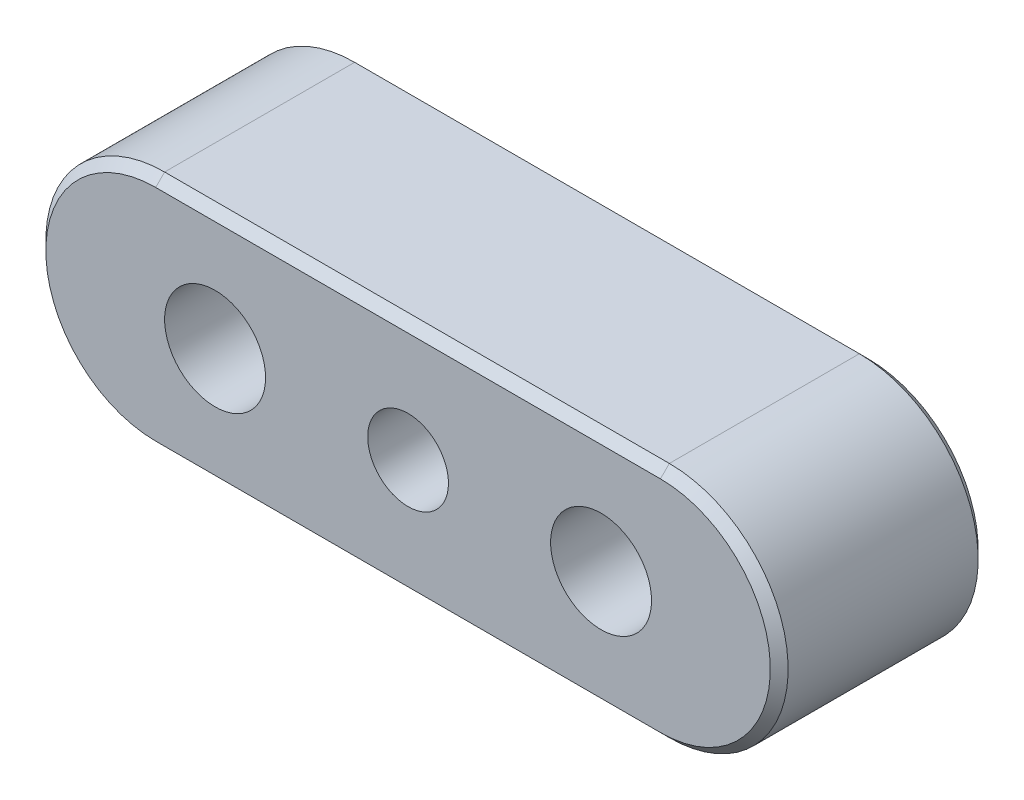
ISO-10303-21;
HEADER;
FILE_DESCRIPTION(('STEP AP214'),'2;1');
FILE_NAME('part.step','',(''),(''),'','','');
FILE_SCHEMA(('AUTOMOTIVE_DESIGN { 1 0 10303 214 1 1 1 1 }'));
ENDSEC;
DATA;
#1=APPLICATION_CONTEXT('core data for automotive mechanical design processes');
#2=APPLICATION_PROTOCOL_DEFINITION('international standard','automotive_design',2000,#1);
#3=PRODUCT_CONTEXT('',#1,'mechanical');
#4=PRODUCT('Part','Part','',(#3));
#5=PRODUCT_RELATED_PRODUCT_CATEGORY('part','',(#4));
#6=PRODUCT_DEFINITION_FORMATION('','',#4);
#7=PRODUCT_DEFINITION_CONTEXT('part definition',#1,'design');
#8=PRODUCT_DEFINITION('design','',#6,#7);
#9=PRODUCT_DEFINITION_SHAPE('','',#8);
#10=(LENGTH_UNIT() NAMED_UNIT(*) SI_UNIT(.MILLI.,.METRE.));
#11=(NAMED_UNIT(*) PLANE_ANGLE_UNIT() SI_UNIT($,.RADIAN.));
#12=(NAMED_UNIT(*) SI_UNIT($,.STERADIAN.) SOLID_ANGLE_UNIT());
#13=UNCERTAINTY_MEASURE_WITH_UNIT(LENGTH_MEASURE(1.E-05),#10,'distance_accuracy_value','');
#14=(GEOMETRIC_REPRESENTATION_CONTEXT(3) GLOBAL_UNCERTAINTY_ASSIGNED_CONTEXT((#13)) GLOBAL_UNIT_ASSIGNED_CONTEXT((#10,
#11,#12)) REPRESENTATION_CONTEXT('',''));
#15=CARTESIAN_POINT('',(0.,0.,0.));
#16=DIRECTION('',(0.,0.,1.));
#17=DIRECTION('',(1.,0.,0.));
#18=AXIS2_PLACEMENT_3D('',#15,#16,#17);
#19=CARTESIAN_POINT('',(-15.,0.,-3.5));
#20=DIRECTION('',(0.,0.,1.));
#21=DIRECTION('',(1.,0.,0.));
#22=AXIS2_PLACEMENT_3D('',#19,#20,#21);
#23=CYLINDRICAL_SURFACE('',#22,1.7);
#24=CARTESIAN_POINT('',(-15.,0.,3.5));
#25=DIRECTION('',(0.,0.,1.));
#26=DIRECTION('',(1.,0.,0.));
#27=AXIS2_PLACEMENT_3D('',#24,#25,#26);
#28=CIRCLE('',#27,1.7);
#29=CARTESIAN_POINT('',(-13.3,0.,3.5));
#30=VERTEX_POINT('',#29);
#31=EDGE_CURVE('E194',#30,#30,#28,.T.);
#32=ORIENTED_EDGE('',*,*,#31,.T.);
#33=EDGE_LOOP('',(#32));
#34=FACE_BOUND('',#33,.T.);
#35=CARTESIAN_POINT('',(-15.,0.,-1.09999999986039));
#36=DIRECTION('',(0.,0.,-1.));
#37=DIRECTION('',(-1.,0.,0.));
#38=AXIS2_PLACEMENT_3D('',#35,#36,#37);
#39=CIRCLE('',#38,1.7);
#40=CARTESIAN_POINT('',(-16.7,0.,-1.09999999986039));
#41=VERTEX_POINT('',#40);
#42=EDGE_CURVE('E187',#41,#41,#39,.F.);
#43=ORIENTED_EDGE('',*,*,#42,.F.);
#44=EDGE_LOOP('',(#43));
#45=FACE_BOUND('',#44,.T.);
#46=ADVANCED_FACE('F44',(#34,#45),#23,.F.);
#47=CARTESIAN_POINT('',(-2.00000000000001,0.,-3.5));
#48=DIRECTION('',(0.,0.,1.));
#49=DIRECTION('',(1.,0.,0.));
#50=AXIS2_PLACEMENT_3D('',#47,#48,#49);
#51=CYLINDRICAL_SURFACE('',#50,1.7);
#52=CARTESIAN_POINT('',(-2.00000000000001,0.,3.5));
#53=DIRECTION('',(0.,0.,1.));
#54=DIRECTION('',(1.,0.,0.));
#55=AXIS2_PLACEMENT_3D('',#52,#53,#54);
#56=CIRCLE('',#55,1.7);
#57=CARTESIAN_POINT('',(-0.300000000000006,0.,3.5));
#58=VERTEX_POINT('',#57);
#59=EDGE_CURVE('E206',#58,#58,#56,.T.);
#60=ORIENTED_EDGE('',*,*,#59,.T.);
#61=EDGE_LOOP('',(#60));
#62=FACE_BOUND('',#61,.T.);
#63=CARTESIAN_POINT('',(-2.00000000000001,0.,-1.09999999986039));
#64=DIRECTION('',(0.,0.,-1.));
#65=DIRECTION('',(-1.,0.,0.));
#66=AXIS2_PLACEMENT_3D('',#63,#64,#65);
#67=CIRCLE('',#66,1.7);
#68=CARTESIAN_POINT('',(-3.70000000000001,0.,-1.09999999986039));
#69=VERTEX_POINT('',#68);
#70=EDGE_CURVE('E193',#69,#69,#67,.F.);
#71=ORIENTED_EDGE('',*,*,#70,.F.);
#72=EDGE_LOOP('',(#71));
#73=FACE_BOUND('',#72,.T.);
#74=ADVANCED_FACE('F261',(#62,#73),#51,.F.);
#75=CARTESIAN_POINT('',(-17.,0.,3.5));
#76=DIRECTION('',(0.,0.,-1.));
#77=DIRECTION('',(-1.,0.,0.));
#78=AXIS2_PLACEMENT_3D('',#75,#76,#77);
#79=CYLINDRICAL_SURFACE('',#78,4.);
#80=DIRECTION('',(0.,0.,-1.));
#81=VECTOR('',#80,1.);
#82=CARTESIAN_POINT('',(-17.,4.,3.5));
#83=LINE('',#82,#81);
#84=CARTESIAN_POINT('',(-17.,4.,3.2));
#85=VERTEX_POINT('',#84);
#86=CARTESIAN_POINT('',(-17.,4.,-3.2));
#87=VERTEX_POINT('',#86);
#88=EDGE_CURVE('E114',#85,#87,#83,.T.);
#89=ORIENTED_EDGE('',*,*,#88,.T.);
#90=CARTESIAN_POINT('',(-17.,0.,-3.2));
#91=DIRECTION('',(0.,0.,-1.));
#92=DIRECTION('',(-1.,0.,0.));
#93=AXIS2_PLACEMENT_3D('',#90,#91,#92);
#94=CIRCLE('',#93,4.);
#95=CARTESIAN_POINT('',(-17.,-4.,-3.2));
#96=VERTEX_POINT('',#95);
#97=EDGE_CURVE('E65',#87,#96,#94,.F.);
#98=ORIENTED_EDGE('',*,*,#97,.T.);
#99=DIRECTION('',(0.,0.,-1.));
#100=VECTOR('',#99,1.);
#101=CARTESIAN_POINT('',(-17.,-4.,3.5));
#102=LINE('',#101,#100);
#103=CARTESIAN_POINT('',(-17.,-4.,3.2));
#104=VERTEX_POINT('',#103);
#105=EDGE_CURVE('E116',#104,#96,#102,.T.);
#106=ORIENTED_EDGE('',*,*,#105,.F.);
#107=CARTESIAN_POINT('',(-17.,0.,3.2));
#108=DIRECTION('',(0.,0.,-1.));
#109=DIRECTION('',(-1.,0.,0.));
#110=AXIS2_PLACEMENT_3D('',#107,#108,#109);
#111=CIRCLE('',#110,4.);
#112=EDGE_CURVE('E115',#104,#85,#111,.T.);
#113=ORIENTED_EDGE('',*,*,#112,.T.);
#114=EDGE_LOOP('',(#89,#98,#106,#113));
#115=FACE_BOUND('',#114,.T.);
#116=ADVANCED_FACE('F112',(#115),#79,.T.);
#117=CARTESIAN_POINT('',(0.,-4.,3.5));
#118=DIRECTION('',(0.,1.,0.));
#119=DIRECTION('',(-1.,0.,0.));
#120=AXIS2_PLACEMENT_3D('',#117,#118,#119);
#121=PLANE('',#120);
#122=DIRECTION('',(0.,0.,-1.));
#123=VECTOR('',#122,1.);
#124=CARTESIAN_POINT('',(0.,-4.,3.5));
#125=LINE('',#124,#123);
#126=CARTESIAN_POINT('',(0.,-4.,3.2));
#127=VERTEX_POINT('',#126);
#128=CARTESIAN_POINT('',(0.,-4.,-3.2));
#129=VERTEX_POINT('',#128);
#130=EDGE_CURVE('E205',#127,#129,#125,.T.);
#131=ORIENTED_EDGE('',*,*,#130,.F.);
#132=DIRECTION('',(-1.,0.,0.));
#133=VECTOR('',#132,1.);
#134=CARTESIAN_POINT('',(0.,-4.,3.2));
#135=LINE('',#134,#133);
#136=EDGE_CURVE('E119',#127,#104,#135,.T.);
#137=ORIENTED_EDGE('',*,*,#136,.T.);
#138=ORIENTED_EDGE('',*,*,#105,.T.);
#139=DIRECTION('',(1.,0.,0.));
#140=VECTOR('',#139,1.);
#141=CARTESIAN_POINT('',(0.,-4.,-3.2));
#142=LINE('',#141,#140);
#143=EDGE_CURVE('E168',#96,#129,#142,.T.);
#144=ORIENTED_EDGE('',*,*,#143,.T.);
#145=EDGE_LOOP('',(#131,#137,#138,#144));
#146=FACE_BOUND('',#145,.T.);
#147=ADVANCED_FACE('F284',(#146),#121,.F.);
#148=CARTESIAN_POINT('',(0.,0.,3.5));
#149=DIRECTION('',(0.,0.,-1.));
#150=DIRECTION('',(-1.,0.,0.));
#151=AXIS2_PLACEMENT_3D('',#148,#149,#150);
#152=CYLINDRICAL_SURFACE('',#151,4.);
#153=ORIENTED_EDGE('',*,*,#130,.T.);
#154=CARTESIAN_POINT('',(0.,0.,-3.2));
#155=DIRECTION('',(0.,0.,-1.));
#156=DIRECTION('',(-1.,0.,0.));
#157=AXIS2_PLACEMENT_3D('',#154,#155,#156);
#158=CIRCLE('',#157,4.);
#159=CARTESIAN_POINT('',(0.,4.,-3.2));
#160=VERTEX_POINT('',#159);
#161=EDGE_CURVE('E11',#129,#160,#158,.F.);
#162=ORIENTED_EDGE('',*,*,#161,.T.);
#163=DIRECTION('',(0.,0.,-1.));
#164=VECTOR('',#163,1.);
#165=CARTESIAN_POINT('',(0.,4.,3.5));
#166=LINE('',#165,#164);
#167=CARTESIAN_POINT('',(0.,4.,3.2));
#168=VERTEX_POINT('',#167);
#169=EDGE_CURVE('E134',#168,#160,#166,.T.);
#170=ORIENTED_EDGE('',*,*,#169,.F.);
#171=CARTESIAN_POINT('',(0.,0.,3.2));
#172=DIRECTION('',(0.,0.,-1.));
#173=DIRECTION('',(-1.,0.,0.));
#174=AXIS2_PLACEMENT_3D('',#171,#172,#173);
#175=CIRCLE('',#174,4.);
#176=EDGE_CURVE('E53',#168,#127,#175,.T.);
#177=ORIENTED_EDGE('',*,*,#176,.T.);
#178=EDGE_LOOP('',(#153,#162,#170,#177));
#179=FACE_BOUND('',#178,.T.);
#180=ADVANCED_FACE('F276',(#179),#152,.T.);
#181=CARTESIAN_POINT('',(-17.,4.,3.5));
#182=DIRECTION('',(0.,-1.,0.));
#183=DIRECTION('',(0.,0.,-1.));
#184=AXIS2_PLACEMENT_3D('',#181,#182,#183);
#185=PLANE('',#184);
#186=ORIENTED_EDGE('',*,*,#169,.T.);
#187=DIRECTION('',(-1.,0.,0.));
#188=VECTOR('',#187,1.);
#189=CARTESIAN_POINT('',(-17.,4.,-3.2));
#190=LINE('',#189,#188);
#191=EDGE_CURVE('E127',#160,#87,#190,.T.);
#192=ORIENTED_EDGE('',*,*,#191,.T.);
#193=ORIENTED_EDGE('',*,*,#88,.F.);
#194=DIRECTION('',(1.,0.,0.));
#195=VECTOR('',#194,1.);
#196=CARTESIAN_POINT('',(-17.,4.,3.2));
#197=LINE('',#196,#195);
#198=EDGE_CURVE('E130',#85,#168,#197,.T.);
#199=ORIENTED_EDGE('',*,*,#198,.T.);
#200=EDGE_LOOP('',(#186,#192,#193,#199));
#201=FACE_BOUND('',#200,.T.);
#202=ADVANCED_FACE('F128',(#201),#185,.F.);
#203=CARTESIAN_POINT('',(-17.,0.,3.5));
#204=DIRECTION('',(0.,0.,-1.));
#205=DIRECTION('',(-1.,0.,0.));
#206=AXIS2_PLACEMENT_3D('',#203,#204,#205);
#207=PLANE('',#206);
#208=CARTESIAN_POINT('',(-17.,0.,3.5));
#209=DIRECTION('',(0.,0.,-1.));
#210=DIRECTION('',(-1.,0.,0.));
#211=AXIS2_PLACEMENT_3D('',#208,#209,#210);
#212=CIRCLE('',#211,3.7);
#213=CARTESIAN_POINT('',(-17.,3.7,3.5));
#214=VERTEX_POINT('',#213);
#215=CARTESIAN_POINT('',(-17.,-3.7,3.5));
#216=VERTEX_POINT('',#215);
#217=EDGE_CURVE('E143',#214,#216,#212,.F.);
#218=ORIENTED_EDGE('',*,*,#217,.T.);
#219=DIRECTION('',(1.,0.,0.));
#220=VECTOR('',#219,1.);
#221=CARTESIAN_POINT('',(-17.,-3.7,3.5));
#222=LINE('',#221,#220);
#223=CARTESIAN_POINT('',(0.,-3.7,3.5));
#224=VERTEX_POINT('',#223);
#225=EDGE_CURVE('E166',#216,#224,#222,.T.);
#226=ORIENTED_EDGE('',*,*,#225,.T.);
#227=CARTESIAN_POINT('',(0.,0.,3.5));
#228=DIRECTION('',(0.,0.,-1.));
#229=DIRECTION('',(-1.,0.,0.));
#230=AXIS2_PLACEMENT_3D('',#227,#228,#229);
#231=CIRCLE('',#230,3.7);
#232=CARTESIAN_POINT('',(0.,3.7,3.5));
#233=VERTEX_POINT('',#232);
#234=EDGE_CURVE('E171',#224,#233,#231,.F.);
#235=ORIENTED_EDGE('',*,*,#234,.T.);
#236=DIRECTION('',(-1.,0.,0.));
#237=VECTOR('',#236,1.);
#238=CARTESIAN_POINT('',(-17.,3.7,3.5));
#239=LINE('',#238,#237);
#240=EDGE_CURVE('E172',#233,#214,#239,.T.);
#241=ORIENTED_EDGE('',*,*,#240,.T.);
#242=EDGE_LOOP('',(#218,#226,#235,#241));
#243=FACE_BOUND('',#242,.T.);
#244=ORIENTED_EDGE('',*,*,#31,.F.);
#245=EDGE_LOOP('',(#244));
#246=FACE_BOUND('',#245,.T.);
#247=ORIENTED_EDGE('',*,*,#59,.F.);
#248=EDGE_LOOP('',(#247));
#249=FACE_BOUND('',#248,.T.);
#250=CARTESIAN_POINT('',(-8.5,0.,3.5));
#251=DIRECTION('',(0.,0.,1.));
#252=DIRECTION('',(1.,0.,0.));
#253=AXIS2_PLACEMENT_3D('',#250,#251,#252);
#254=CIRCLE('',#253,1.36);
#255=CARTESIAN_POINT('',(-7.14,0.,3.5));
#256=VERTEX_POINT('',#255);
#257=EDGE_CURVE('E131',#256,#256,#254,.T.);
#258=ORIENTED_EDGE('',*,*,#257,.F.);
#259=EDGE_LOOP('',(#258));
#260=FACE_BOUND('',#259,.T.);
#261=ADVANCED_FACE('F236',(#243,#246,#249,#260),#207,.F.);
#262=CARTESIAN_POINT('',(-17.,0.,-3.5));
#263=DIRECTION('',(0.,0.,-1.));
#264=DIRECTION('',(-1.,0.,0.));
#265=AXIS2_PLACEMENT_3D('',#262,#263,#264);
#266=PLANE('',#265);
#267=CARTESIAN_POINT('',(-17.,0.,-3.5));
#268=DIRECTION('',(0.,0.,-1.));
#269=DIRECTION('',(-1.,0.,0.));
#270=AXIS2_PLACEMENT_3D('',#267,#268,#269);
#271=CIRCLE('',#270,3.7);
#272=CARTESIAN_POINT('',(-17.,-3.7,-3.5));
#273=VERTEX_POINT('',#272);
#274=CARTESIAN_POINT('',(-17.,3.7,-3.5));
#275=VERTEX_POINT('',#274);
#276=EDGE_CURVE('E177',#273,#275,#271,.T.);
#277=ORIENTED_EDGE('',*,*,#276,.T.);
#278=DIRECTION('',(1.,0.,0.));
#279=VECTOR('',#278,1.);
#280=CARTESIAN_POINT('',(0.,3.7,-3.5));
#281=LINE('',#280,#279);
#282=CARTESIAN_POINT('',(0.,3.7,-3.5));
#283=VERTEX_POINT('',#282);
#284=EDGE_CURVE('E176',#275,#283,#281,.T.);
#285=ORIENTED_EDGE('',*,*,#284,.T.);
#286=CARTESIAN_POINT('',(0.,0.,-3.5));
#287=DIRECTION('',(0.,0.,-1.));
#288=DIRECTION('',(-1.,0.,0.));
#289=AXIS2_PLACEMENT_3D('',#286,#287,#288);
#290=CIRCLE('',#289,3.7);
#291=CARTESIAN_POINT('',(0.,-3.7,-3.5));
#292=VERTEX_POINT('',#291);
#293=EDGE_CURVE('E181',#283,#292,#290,.T.);
#294=ORIENTED_EDGE('',*,*,#293,.T.);
#295=DIRECTION('',(-1.,0.,0.));
#296=VECTOR('',#295,1.);
#297=CARTESIAN_POINT('',(-17.,-3.7,-3.5));
#298=LINE('',#297,#296);
#299=EDGE_CURVE('E182',#292,#273,#298,.T.);
#300=ORIENTED_EDGE('',*,*,#299,.T.);
#301=EDGE_LOOP('',(#277,#285,#294,#300));
#302=FACE_BOUND('',#301,.T.);
#303=CARTESIAN_POINT('',(-15.,0.,-3.49999999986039));
#304=DIRECTION('',(0.,0.,-1.));
#305=DIRECTION('',(-1.,0.,0.));
#306=AXIS2_PLACEMENT_3D('',#303,#304,#305);
#307=CIRCLE('',#306,3.);
#308=CARTESIAN_POINT('',(-18.,0.,-3.49999999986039));
#309=VERTEX_POINT('',#308);
#310=EDGE_CURVE('E156',#309,#309,#307,.T.);
#311=ORIENTED_EDGE('',*,*,#310,.F.);
#312=EDGE_LOOP('',(#311));
#313=FACE_BOUND('',#312,.T.);
#314=CARTESIAN_POINT('',(-2.00000000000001,0.,-3.49999999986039));
#315=DIRECTION('',(0.,0.,-1.));
#316=DIRECTION('',(-1.,0.,0.));
#317=AXIS2_PLACEMENT_3D('',#314,#315,#316);
#318=CIRCLE('',#317,3.);
#319=CARTESIAN_POINT('',(-5.00000000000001,0.,-3.49999999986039));
#320=VERTEX_POINT('',#319);
#321=EDGE_CURVE('E186',#320,#320,#318,.T.);
#322=ORIENTED_EDGE('',*,*,#321,.F.);
#323=EDGE_LOOP('',(#322));
#324=FACE_BOUND('',#323,.T.);
#325=CARTESIAN_POINT('',(-8.5,0.,-3.5));
#326=DIRECTION('',(0.,0.,-1.));
#327=DIRECTION('',(-1.,0.,0.));
#328=AXIS2_PLACEMENT_3D('',#325,#326,#327);
#329=CIRCLE('',#328,1.87961524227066);
#330=CARTESIAN_POINT('',(-10.3796152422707,0.,-3.5));
#331=VERTEX_POINT('',#330);
#332=EDGE_CURVE('E200',#331,#331,#329,.F.);
#333=ORIENTED_EDGE('',*,*,#332,.T.);
#334=EDGE_LOOP('',(#333));
#335=FACE_BOUND('',#334,.T.);
#336=ADVANCED_FACE('F235',(#302,#313,#324,#335),#266,.T.);
#337=CARTESIAN_POINT('',(-8.5,0.,-3.5));
#338=DIRECTION('',(0.,0.,1.));
#339=DIRECTION('',(1.,0.,0.));
#340=AXIS2_PLACEMENT_3D('',#337,#338,#339);
#341=CYLINDRICAL_SURFACE('',#340,1.36);
#342=CARTESIAN_POINT('',(-8.5,0.,-3.2));
#343=DIRECTION('',(0.,0.,-1.));
#344=DIRECTION('',(-1.,0.,0.));
#345=AXIS2_PLACEMENT_3D('',#342,#343,#344);
#346=CIRCLE('',#345,1.36);
#347=CARTESIAN_POINT('',(-9.86,0.,-3.2));
#348=VERTEX_POINT('',#347);
#349=EDGE_CURVE('E145',#348,#348,#346,.T.);
#350=ORIENTED_EDGE('',*,*,#349,.T.);
#351=EDGE_LOOP('',(#350));
#352=FACE_BOUND('',#351,.T.);
#353=ORIENTED_EDGE('',*,*,#257,.T.);
#354=EDGE_LOOP('',(#353));
#355=FACE_BOUND('',#354,.T.);
#356=ADVANCED_FACE('F232',(#352,#355),#341,.F.);
#357=CARTESIAN_POINT('',(-8.5,0.,-3.5));
#358=DIRECTION('',(0.,0.,-1.));
#359=DIRECTION('',(-1.,0.,0.));
#360=AXIS2_PLACEMENT_3D('',#357,#358,#359);
#361=CONICAL_SURFACE('',#360,1.87961524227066,1.04719755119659);
#362=ORIENTED_EDGE('',*,*,#349,.F.);
#363=EDGE_LOOP('',(#362));
#364=FACE_BOUND('',#363,.T.);
#365=ORIENTED_EDGE('',*,*,#332,.F.);
#366=EDGE_LOOP('',(#365));
#367=FACE_BOUND('',#366,.T.);
#368=ADVANCED_FACE('F243',(#364,#367),#361,.F.);
#369=CARTESIAN_POINT('',(-2.00000000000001,0.,-1.09999999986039));
#370=DIRECTION('',(0.,0.,-1.));
#371=DIRECTION('',(-1.,0.,0.));
#372=AXIS2_PLACEMENT_3D('',#369,#370,#371);
#373=PLANE('',#372);
#374=CARTESIAN_POINT('',(-2.00000000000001,0.,-1.09999999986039));
#375=DIRECTION('',(0.,0.,-1.));
#376=DIRECTION('',(-1.,0.,0.));
#377=AXIS2_PLACEMENT_3D('',#374,#375,#376);
#378=CIRCLE('',#377,3.);
#379=CARTESIAN_POINT('',(-5.00000000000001,0.,-1.09999999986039));
#380=VERTEX_POINT('',#379);
#381=EDGE_CURVE('E192',#380,#380,#378,.T.);
#382=ORIENTED_EDGE('',*,*,#381,.T.);
#383=EDGE_LOOP('',(#382));
#384=FACE_BOUND('',#383,.T.);
#385=ORIENTED_EDGE('',*,*,#70,.T.);
#386=EDGE_LOOP('',(#385));
#387=FACE_BOUND('',#386,.T.);
#388=ADVANCED_FACE('F244',(#384,#387),#373,.T.);
#389=CARTESIAN_POINT('',(-2.00000000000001,0.,-1.09999999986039));
#390=DIRECTION('',(0.,0.,-1.));
#391=DIRECTION('',(-1.,0.,0.));
#392=AXIS2_PLACEMENT_3D('',#389,#390,#391);
#393=CYLINDRICAL_SURFACE('',#392,3.);
#394=ORIENTED_EDGE('',*,*,#381,.F.);
#395=EDGE_LOOP('',(#394));
#396=FACE_BOUND('',#395,.T.);
#397=ORIENTED_EDGE('',*,*,#321,.T.);
#398=EDGE_LOOP('',(#397));
#399=FACE_BOUND('',#398,.T.);
#400=ADVANCED_FACE('F254',(#396,#399),#393,.F.);
#401=CARTESIAN_POINT('',(-15.,0.,-1.09999999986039));
#402=DIRECTION('',(0.,0.,-1.));
#403=DIRECTION('',(-1.,0.,0.));
#404=AXIS2_PLACEMENT_3D('',#401,#402,#403);
#405=PLANE('',#404);
#406=CARTESIAN_POINT('',(-15.,0.,-1.09999999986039));
#407=DIRECTION('',(0.,0.,-1.));
#408=DIRECTION('',(-1.,0.,0.));
#409=AXIS2_PLACEMENT_3D('',#406,#407,#408);
#410=CIRCLE('',#409,3.);
#411=CARTESIAN_POINT('',(-18.,0.,-1.09999999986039));
#412=VERTEX_POINT('',#411);
#413=EDGE_CURVE('E188',#412,#412,#410,.T.);
#414=ORIENTED_EDGE('',*,*,#413,.T.);
#415=EDGE_LOOP('',(#414));
#416=FACE_BOUND('',#415,.T.);
#417=ORIENTED_EDGE('',*,*,#42,.T.);
#418=EDGE_LOOP('',(#417));
#419=FACE_BOUND('',#418,.T.);
#420=ADVANCED_FACE('F225',(#416,#419),#405,.T.);
#421=CARTESIAN_POINT('',(-15.,0.,-1.09999999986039));
#422=DIRECTION('',(0.,0.,-1.));
#423=DIRECTION('',(-1.,0.,0.));
#424=AXIS2_PLACEMENT_3D('',#421,#422,#423);
#425=CYLINDRICAL_SURFACE('',#424,3.);
#426=ORIENTED_EDGE('',*,*,#413,.F.);
#427=EDGE_LOOP('',(#426));
#428=FACE_BOUND('',#427,.T.);
#429=ORIENTED_EDGE('',*,*,#310,.T.);
#430=EDGE_LOOP('',(#429));
#431=FACE_BOUND('',#430,.T.);
#432=ADVANCED_FACE('F222',(#428,#431),#425,.F.);
#433=CARTESIAN_POINT('',(0.,-4.,-3.2));
#434=DIRECTION('',(0.,-0.707106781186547,-0.707106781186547));
#435=DIRECTION('',(0.,0.707106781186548,-0.707106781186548));
#436=AXIS2_PLACEMENT_3D('',#433,#434,#435);
#437=PLANE('',#436);
#438=DIRECTION('',(0.,-0.707106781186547,0.707106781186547));
#439=VECTOR('',#438,1.);
#440=CARTESIAN_POINT('',(-17.,-3.7,-3.5));
#441=LINE('',#440,#439);
#442=EDGE_CURVE('E159',#273,#96,#441,.T.);
#443=ORIENTED_EDGE('',*,*,#442,.F.);
#444=ORIENTED_EDGE('',*,*,#299,.F.);
#445=DIRECTION('',(0.,0.707106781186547,-0.707106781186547));
#446=VECTOR('',#445,1.);
#447=CARTESIAN_POINT('',(0.,-4.,-3.2));
#448=LINE('',#447,#446);
#449=EDGE_CURVE('E152',#129,#292,#448,.T.);
#450=ORIENTED_EDGE('',*,*,#449,.F.);
#451=ORIENTED_EDGE('',*,*,#143,.F.);
#452=EDGE_LOOP('',(#443,#444,#450,#451));
#453=FACE_BOUND('',#452,.T.);
#454=ADVANCED_FACE('F226',(#453),#437,.T.);
#455=CARTESIAN_POINT('',(0.,0.,-3.2));
#456=DIRECTION('',(0.,0.,1.));
#457=DIRECTION('',(1.,0.,0.));
#458=AXIS2_PLACEMENT_3D('',#455,#456,#457);
#459=CONICAL_SURFACE('',#458,4.,0.785398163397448);
#460=ORIENTED_EDGE('',*,*,#449,.T.);
#461=ORIENTED_EDGE('',*,*,#293,.F.);
#462=DIRECTION('',(0.,-0.707106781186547,-0.707106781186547));
#463=VECTOR('',#462,1.);
#464=CARTESIAN_POINT('',(0.,4.,-3.2));
#465=LINE('',#464,#463);
#466=EDGE_CURVE('E150',#160,#283,#465,.T.);
#467=ORIENTED_EDGE('',*,*,#466,.F.);
#468=ORIENTED_EDGE('',*,*,#161,.F.);
#469=EDGE_LOOP('',(#460,#461,#467,#468));
#470=FACE_BOUND('',#469,.T.);
#471=ADVANCED_FACE('F324',(#470),#459,.T.);
#472=CARTESIAN_POINT('',(-17.,0.,-3.2));
#473=DIRECTION('',(0.,0.,1.));
#474=DIRECTION('',(1.,0.,0.));
#475=AXIS2_PLACEMENT_3D('',#472,#473,#474);
#476=CONICAL_SURFACE('',#475,4.,0.785398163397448);
#477=ORIENTED_EDGE('',*,*,#442,.T.);
#478=ORIENTED_EDGE('',*,*,#97,.F.);
#479=DIRECTION('',(0.,0.707106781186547,0.707106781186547));
#480=VECTOR('',#479,1.);
#481=CARTESIAN_POINT('',(-17.,3.7,-3.5));
#482=LINE('',#481,#480);
#483=EDGE_CURVE('E148',#275,#87,#482,.T.);
#484=ORIENTED_EDGE('',*,*,#483,.F.);
#485=ORIENTED_EDGE('',*,*,#276,.F.);
#486=EDGE_LOOP('',(#477,#478,#484,#485));
#487=FACE_BOUND('',#486,.T.);
#488=ADVANCED_FACE('F331',(#487),#476,.T.);
#489=CARTESIAN_POINT('',(-17.,4.,-3.2));
#490=DIRECTION('',(0.,0.707106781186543,-0.707106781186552));
#491=DIRECTION('',(0.,0.707106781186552,0.707106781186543));
#492=AXIS2_PLACEMENT_3D('',#489,#490,#491);
#493=PLANE('',#492);
#494=ORIENTED_EDGE('',*,*,#466,.T.);
#495=ORIENTED_EDGE('',*,*,#284,.F.);
#496=ORIENTED_EDGE('',*,*,#483,.T.);
#497=ORIENTED_EDGE('',*,*,#191,.F.);
#498=EDGE_LOOP('',(#494,#495,#496,#497));
#499=FACE_BOUND('',#498,.T.);
#500=ADVANCED_FACE('F345',(#499),#493,.T.);
#501=CARTESIAN_POINT('',(-17.,3.7,3.5));
#502=DIRECTION('',(0.,-0.707106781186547,-0.707106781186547));
#503=DIRECTION('',(0.,0.707106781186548,-0.707106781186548));
#504=AXIS2_PLACEMENT_3D('',#501,#502,#503);
#505=PLANE('',#504);
#506=DIRECTION('',(0.,-0.707106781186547,0.707106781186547));
#507=VECTOR('',#506,1.);
#508=CARTESIAN_POINT('',(0.,4.,3.2));
#509=LINE('',#508,#507);
#510=EDGE_CURVE('E137',#168,#233,#509,.T.);
#511=ORIENTED_EDGE('',*,*,#510,.F.);
#512=ORIENTED_EDGE('',*,*,#198,.F.);
#513=DIRECTION('',(0.,0.707106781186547,-0.707106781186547));
#514=VECTOR('',#513,1.);
#515=CARTESIAN_POINT('',(-17.,3.7,3.5));
#516=LINE('',#515,#514);
#517=EDGE_CURVE('E47',#214,#85,#516,.T.);
#518=ORIENTED_EDGE('',*,*,#517,.F.);
#519=ORIENTED_EDGE('',*,*,#240,.F.);
#520=EDGE_LOOP('',(#511,#512,#518,#519));
#521=FACE_BOUND('',#520,.T.);
#522=ADVANCED_FACE('F50',(#521),#505,.F.);
#523=CARTESIAN_POINT('',(-17.,0.,3.5));
#524=DIRECTION('',(0.,0.,-1.));
#525=DIRECTION('',(-1.,0.,0.));
#526=AXIS2_PLACEMENT_3D('',#523,#524,#525);
#527=CONICAL_SURFACE('',#526,3.7,0.785398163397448);
#528=ORIENTED_EDGE('',*,*,#517,.T.);
#529=ORIENTED_EDGE('',*,*,#112,.F.);
#530=DIRECTION('',(0.,-0.707106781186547,-0.707106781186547));
#531=VECTOR('',#530,1.);
#532=CARTESIAN_POINT('',(-17.,-3.7,3.5));
#533=LINE('',#532,#531);
#534=EDGE_CURVE('E67',#216,#104,#533,.T.);
#535=ORIENTED_EDGE('',*,*,#534,.F.);
#536=ORIENTED_EDGE('',*,*,#217,.F.);
#537=EDGE_LOOP('',(#528,#529,#535,#536));
#538=FACE_BOUND('',#537,.T.);
#539=ADVANCED_FACE('F144',(#538),#527,.T.);
#540=CARTESIAN_POINT('',(0.,0.,3.5));
#541=DIRECTION('',(0.,0.,-1.));
#542=DIRECTION('',(-1.,0.,0.));
#543=AXIS2_PLACEMENT_3D('',#540,#541,#542);
#544=CONICAL_SURFACE('',#543,3.7,0.785398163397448);
#545=ORIENTED_EDGE('',*,*,#510,.T.);
#546=ORIENTED_EDGE('',*,*,#234,.F.);
#547=DIRECTION('',(0.,0.707106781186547,0.707106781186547));
#548=VECTOR('',#547,1.);
#549=CARTESIAN_POINT('',(0.,-4.,3.2));
#550=LINE('',#549,#548);
#551=EDGE_CURVE('E154',#127,#224,#550,.T.);
#552=ORIENTED_EDGE('',*,*,#551,.F.);
#553=ORIENTED_EDGE('',*,*,#176,.F.);
#554=EDGE_LOOP('',(#545,#546,#552,#553));
#555=FACE_BOUND('',#554,.T.);
#556=ADVANCED_FACE('F364',(#555),#544,.T.);
#557=CARTESIAN_POINT('',(-17.,-3.7,3.5));
#558=DIRECTION('',(0.,0.707106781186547,-0.707106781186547));
#559=DIRECTION('',(0.,0.707106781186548,0.707106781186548));
#560=AXIS2_PLACEMENT_3D('',#557,#558,#559);
#561=PLANE('',#560);
#562=ORIENTED_EDGE('',*,*,#534,.T.);
#563=ORIENTED_EDGE('',*,*,#136,.F.);
#564=ORIENTED_EDGE('',*,*,#551,.T.);
#565=ORIENTED_EDGE('',*,*,#225,.F.);
#566=EDGE_LOOP('',(#562,#563,#564,#565));
#567=FACE_BOUND('',#566,.T.);
#568=ADVANCED_FACE('F371',(#567),#561,.F.);
#569=CLOSED_SHELL('',(#46,#74,#116,#147,#180,#202,#261,#336,#356,#368,#388,#400,#420,#432,#454,
#471,#488,#500,#522,#539,#556,#568));
#570=MANIFOLD_SOLID_BREP('B2',#569);
#571=ADVANCED_BREP_SHAPE_REPRESENTATION('',(#18,#570),#14);
#572=SHAPE_DEFINITION_REPRESENTATION(#9,#571);
ENDSEC;
END-ISO-10303-21;
